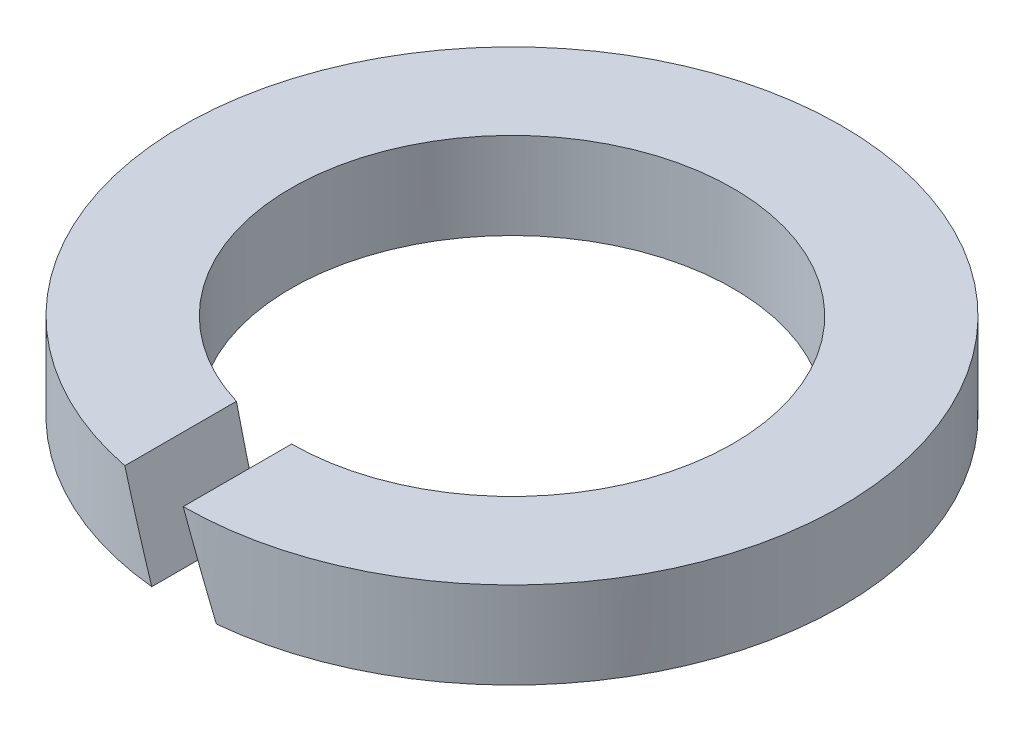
from build123d import *

# Parameters (mm, degrees)
SKE_W          = 2.5
SKE_H          = 2
CUT_REACH      = 12.933
CUT_END_RADIUS = 7.6


with BuildPart() as part:
    # Ske → Base (revolve)
    with BuildSketch(Plane.XY, mode=Mode.PRIVATE) as base_sk:
        with Locations((-6.35, 1)):
            Rectangle(SKE_W, SKE_H)
    revolve(base_sk.sketch.rotate(Axis((0, 15.759672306, 0), (0, -1, 0)), 270), axis=Axis((0, 15.759672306, 0), (0, -1, 0)))

    # Cut: up to this cylinder (the profile starts inside it)
    cut_end = Plane(origin=(0, 1, 0), z_dir=(0, 1, 0)) * Cylinder(CUT_END_RADIUS, 42.066, mode=Mode.PRIVATE)
    # Ske4 → Cut (cut, up to the surface)
    with BuildSketch(Plane.XY, mode=Mode.PRIVATE) as cut_sk1:
        Polygon((-0.744924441, 0), (0.744924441, 0), (0.016983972, 2), (-1.472864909, 2), align=None)
    cut_tool1 = extrude(cut_sk1.sketch, amount=CUT_REACH, mode=Mode.PRIVATE) & cut_end
    add(cut_tool1.solids().sort_by_distance((-0.36397, 1, 0))[0], mode=Mode.SUBTRACT)


solid = part.part
